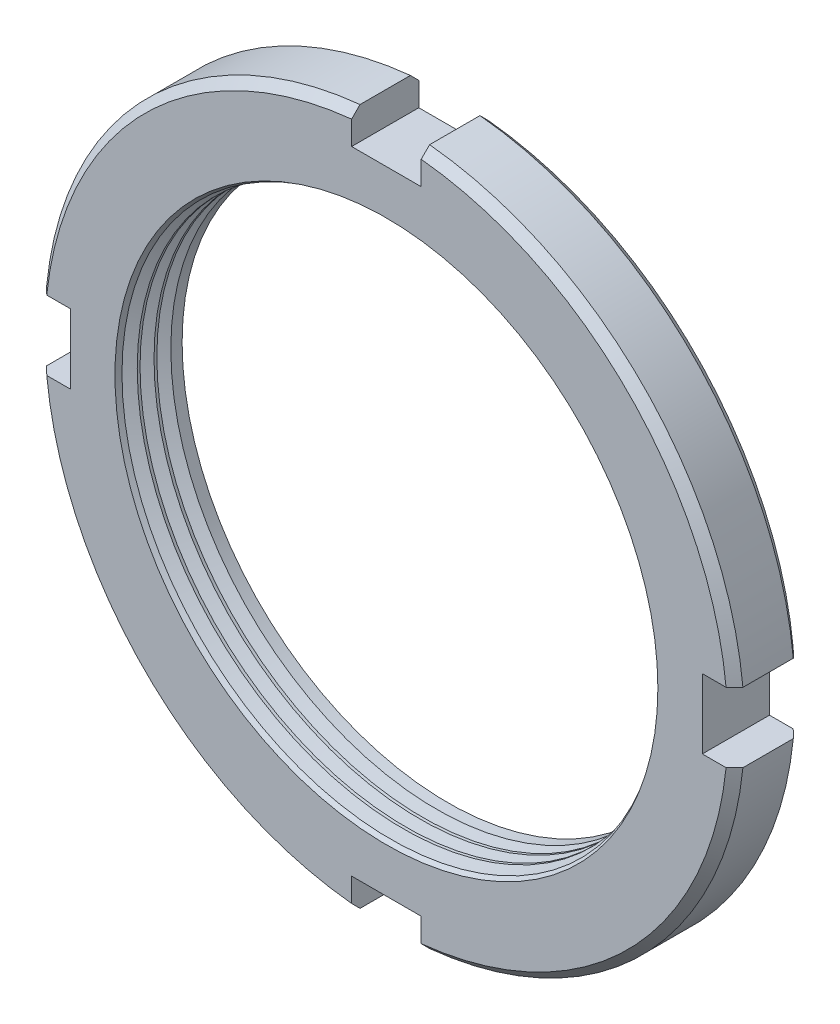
from build123d import *
from OCP.BRepFilletAPI import BRepFilletAPI_MakeChamfer

# Parameters (mm, degrees)
SKETCH2_R        = 62.5
BASENUT_DEPTH    = 12
CHAMFER1_SIZE    = 1.5
SKETCH3_R        = 47.5
HOLE_DEPTH       = 125.194420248
ENDCHAMFER_SIZE  = 1
ENDCHAMFER_SIZE2 = 1.732050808
SLOTCUT_DEPTH    = 145.845597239
SLOTPAT_COUNT    = 4
LPATTERN10_COUNT = 3
LPATTERN10_PITCH = 3


with BuildPart() as part:
    # Sketch2 → BaseNut (new body)
    with BuildSketch(Plane.XY):
        Circle(SKETCH2_R)
    extrude(amount=-BASENUT_DEPTH)

    # Chamfer1
    chamfer1_edges = [part.edges().sort_by_distance(p)[0] for p in [
        (-62.5, 0, 0),
        (-62.5, 0, -12),
    ]]
    chamfer(chamfer1_edges, length=CHAMFER1_SIZE)

    # Sketch3 → Hole (cut, through all)
    with BuildSketch(Plane(origin=(-17.561722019, 31.682666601, 0), x_dir=(1, 0, 0), z_dir=(0, 0, 1))):
        with Locations((17.561722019, -31.682666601)):
            Circle(SKETCH3_R)
    extrude(amount=-HOLE_DEPTH, mode=Mode.SUBTRACT)

    # EndChamfer: one chamfer whose edges measure the first distance from different faces: ONE call of the kernel's chamfer builder (chamfer() names one face for all edges)
    endchamfer_edges_1 = [part.edges().sort_by_distance(p)[0] for p in [
        (-47.5, 0, -12),
    ]]
    endchamfer_side_1 = [part.faces().sort_by_distance(p)[0] for p in [
        (-47.5, 0, -6),
    ]]
    endchamfer_edges_2 = [part.edges().sort_by_distance(p)[0] for p in [
        (-47.5, 0, 0),
    ]]
    endchamfer_side_2 = [part.faces().sort_by_distance(p)[0] for p in [
        (-59.274659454, 0, 0),
    ]]
    endchamfer = BRepFilletAPI_MakeChamfer(part.part.solid().wrapped)
    for e in endchamfer_edges_1:
        endchamfer.Add(ENDCHAMFER_SIZE, ENDCHAMFER_SIZE2, e.wrapped, endchamfer_side_1[0].wrapped)  # the first distance lies on this face
    for e in endchamfer_edges_2:
        endchamfer.Add(ENDCHAMFER_SIZE, ENDCHAMFER_SIZE2, e.wrapped, endchamfer_side_2[0].wrapped)  # the first distance lies on this face
    add(Compound.cast(endchamfer.Shape()), mode=Mode.REPLACE)

    # Sketch4 → SlotCut (cut, through all)
    with BuildSketch(Plane(origin=(-28.84840977, 49.266341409, 0), x_dir=(1, 0, 0), z_dir=(0, 0, 1))):
        with BuildLine():
            Line((22.63340977, 12.923881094), (22.63340977, 7.173881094))
            Line((22.63340977, 7.173881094), (35.06340977, 7.173881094))
            Line((35.06340977, 7.173881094), (35.06340977, 12.923881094))
            ThreePointArc((35.06340977, 12.923881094), (28.84840977, 13.233658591), (22.63340977, 12.923881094))
        make_face()
    slotcut = extrude(amount=-SLOTCUT_DEPTH, mode=Mode.SUBTRACT)

    # SlotPat: SlotCut ×4 about axis
    slotpat_axis = Axis((0, 0, 0), (0, 0, 1))
    for i in range(1, SLOTPAT_COUNT):
        add(slotcut.rotate(slotpat_axis, i * 360 / SLOTPAT_COUNT), mode=Mode.SUBTRACT)

    # Sketch5 → Cut-Revolve10 (revolve, cut)
    with BuildSketch(Plane(origin=(0, 0, 0), x_dir=(1, 0, 0), z_dir=(0, 1, 0))):
        Polygon((45, 2.982050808), (45, 0.482050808), (47.5, 0.482050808), (49.665063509, 1.732050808), (47.5, 2.982050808), align=None)
    cut_revolve10 = revolve(axis=Axis((0, 0, -37.301805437), (0, 0, 1)), mode=Mode.SUBTRACT)

    # LPattern10: Cut-Revolve10 ×3
    with Locations(*[(0, 0, -i * LPATTERN10_PITCH) for i in range(1, LPATTERN10_COUNT)]):
        add(cut_revolve10, mode=Mode.SUBTRACT)


solid = part.part
